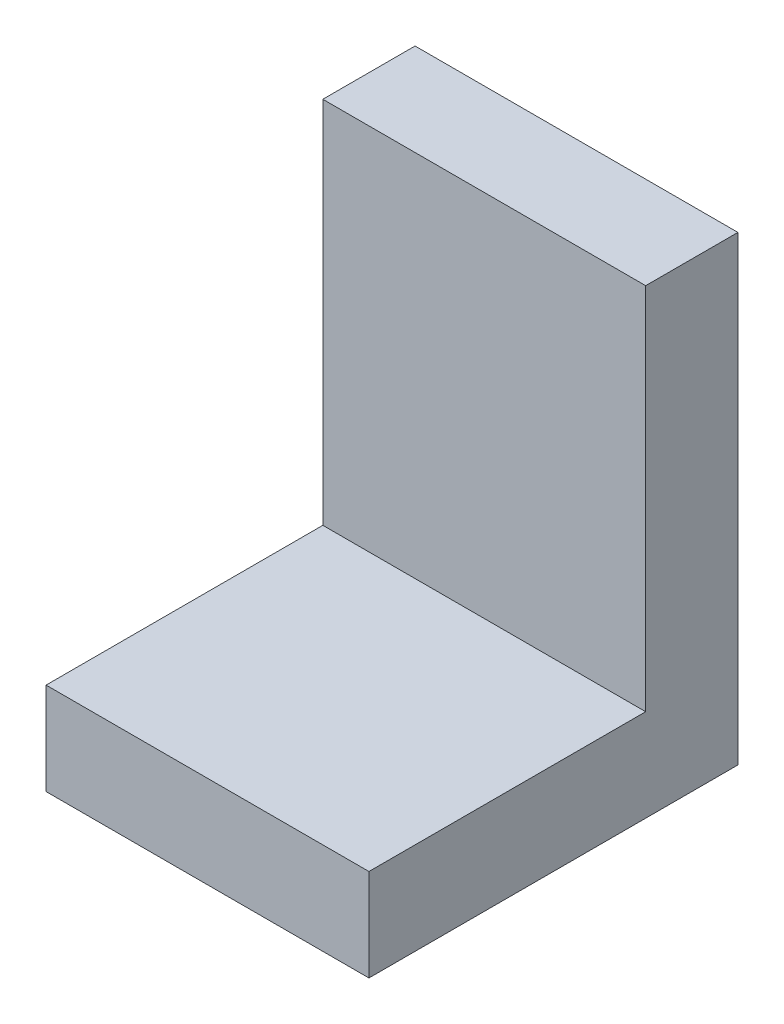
from build123d import *

# Parameters (mm, degrees)
EXTRUDE_THIN1_DEPTH = 44.45


with BuildPart() as part:
    # Sketch1 → Extrude-Thin1 (new, symmetric)
    with BuildSketch(Plane(origin=(0, 0, 0), x_dir=(0, 0, -1), z_dir=(1, 0, 0))):
        Polygon((0, 101.6), (0, 0), (-76.2, 0), (-76.2, -25.4), (25.4, -25.4), (25.4, 101.6), align=None)
    extrude(amount=EXTRUDE_THIN1_DEPTH, both=True)


solid = part.part
